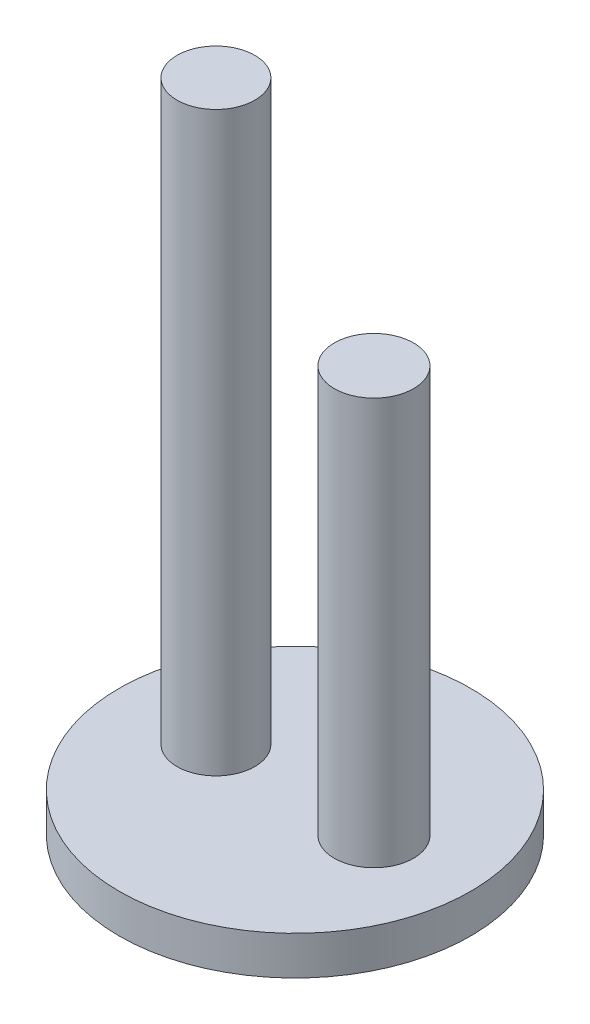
from build123d import *

# Parameters (mm, degrees)
SKETCH1_R           = 11.528213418
BOSS_EXTRUDE1_DEPTH = 2.54
SKETCH2_R           = 2.550086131
BOSS_EXTRUDE3_DEPTH = 37.846
BOSS_EXTRUDE4_DEPTH = 26.67


with BuildPart() as part:
    # Sketch1 → Boss-Extrude1 (new body)
    with BuildSketch(Plane(origin=(0, 0, 0), x_dir=(1, 0, 0), z_dir=(0, 1, 0))):
        with Locations(Location((0, 0, 0), (0, 0, 270))):
            Circle(SKETCH1_R)
    extrude(amount=BOSS_EXTRUDE1_DEPTH)

    # Sketch2 → Boss-Extrude3 (add)
    with BuildSketch(Plane(origin=(0, 2.54, 0), x_dir=(-1, 0, 0), z_dir=(0, 1, 0))):
        with Locations(Location((5.180439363, 0, 0), (0, 0, 90))):
            Circle(SKETCH2_R)
    extrude(amount=BOSS_EXTRUDE3_DEPTH)

    # Sketch2_4 → Boss-Extrude4 (add)
    with BuildSketch(Plane(origin=(0, 2.54, 0), x_dir=(-1, 0, 0), z_dir=(0, 1, 0))):
        with BuildLine():
            ThreePointArc((-5.180439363, -2.599309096), (-3.342450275, -1.837989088), (-2.581130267, 0))
            Line((-2.581130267, 0), (-5.180439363, 0))
            Line((-5.180439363, 0), (-5.180439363, -2.599309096))
        make_face()
        with BuildLine():
            Line((-5.180439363, 0), (-2.581130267, 0))
            ThreePointArc((-2.581130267, 0), (-3.342450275, 1.837989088), (-5.180439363, 2.599309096))
            Line((-5.180439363, 2.599309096), (-5.180439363, 0))
        make_face()
        with BuildLine():
            Line((-5.180439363, -2.599309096), (-5.180439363, 0))
            Line((-5.180439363, 0), (-7.779748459, 0))
            ThreePointArc((-7.779748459, 0), (-7.018428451, -1.837989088), (-5.180439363, -2.599309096))
        make_face()
        with BuildLine():
            Line((-7.779748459, 0), (-5.180439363, 0))
            Line((-5.180439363, 0), (-5.180439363, 2.599309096))
            ThreePointArc((-5.180439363, 2.599309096), (-7.018428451, 1.837989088), (-7.779748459, 0))
        make_face()
        with BuildLine():
            ThreePointArc((-5.180439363, -2.599309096), (-3.342450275, -1.837989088), (-2.581130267, 0))
            Line((-2.581130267, 0), (-5.180439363, 0))
            Line((-5.180439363, 0), (-5.180439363, -2.599309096))
        make_face()
        with BuildLine():
            Line((-5.180439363, 0), (-2.581130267, 0))
            ThreePointArc((-2.581130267, 0), (-3.342450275, 1.837989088), (-5.180439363, 2.599309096))
            Line((-5.180439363, 2.599309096), (-5.180439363, 0))
        make_face()
        with BuildLine():
            Line((-5.180439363, -2.599309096), (-5.180439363, 0))
            Line((-5.180439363, 0), (-7.779748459, 0))
            ThreePointArc((-7.779748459, 0), (-7.018428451, -1.837989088), (-5.180439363, -2.599309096))
        make_face()
        with BuildLine():
            Line((-7.779748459, 0), (-5.180439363, 0))
            Line((-5.180439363, 0), (-5.180439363, 2.599309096))
            ThreePointArc((-5.180439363, 2.599309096), (-7.018428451, 1.837989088), (-7.779748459, 0))
        make_face()
        with BuildLine():
            ThreePointArc((-5.180439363, -2.599309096), (-3.342450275, -1.837989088), (-2.581130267, 0))
            Line((-2.581130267, 0), (-5.180439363, 0))
            Line((-5.180439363, 0), (-5.180439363, -2.599309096))
        make_face()
        with BuildLine():
            Line((-5.180439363, 0), (-2.581130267, 0))
            ThreePointArc((-2.581130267, 0), (-3.342450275, 1.837989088), (-5.180439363, 2.599309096))
            Line((-5.180439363, 2.599309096), (-5.180439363, 0))
        make_face()
        with BuildLine():
            Line((-5.180439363, -2.599309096), (-5.180439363, 0))
            Line((-5.180439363, 0), (-7.779748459, 0))
            ThreePointArc((-7.779748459, 0), (-7.018428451, -1.837989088), (-5.180439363, -2.599309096))
        make_face()
        with BuildLine():
            Line((-7.779748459, 0), (-5.180439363, 0))
            Line((-5.180439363, 0), (-5.180439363, 2.599309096))
            ThreePointArc((-5.180439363, 2.599309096), (-7.018428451, 1.837989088), (-7.779748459, 0))
        make_face()
        with BuildLine():
            ThreePointArc((-5.180439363, -2.599309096), (-3.342450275, -1.837989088), (-2.581130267, 0))
            Line((-2.581130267, 0), (-5.180439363, 0))
            Line((-5.180439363, 0), (-5.180439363, -2.599309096))
        make_face()
        with BuildLine():
            Line((-5.180439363, 0), (-2.581130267, 0))
            ThreePointArc((-2.581130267, 0), (-3.342450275, 1.837989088), (-5.180439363, 2.599309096))
            Line((-5.180439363, 2.599309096), (-5.180439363, 0))
        make_face()
        with BuildLine():
            Line((-5.180439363, -2.599309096), (-5.180439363, 0))
            Line((-5.180439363, 0), (-7.779748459, 0))
            ThreePointArc((-7.779748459, 0), (-7.018428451, -1.837989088), (-5.180439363, -2.599309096))
        make_face()
        with BuildLine():
            Line((-7.779748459, 0), (-5.180439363, 0))
            Line((-5.180439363, 0), (-5.180439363, 2.599309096))
            ThreePointArc((-5.180439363, 2.599309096), (-7.018428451, 1.837989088), (-7.779748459, 0))
        make_face()
    extrude(amount=BOSS_EXTRUDE4_DEPTH)


solid = part.part
